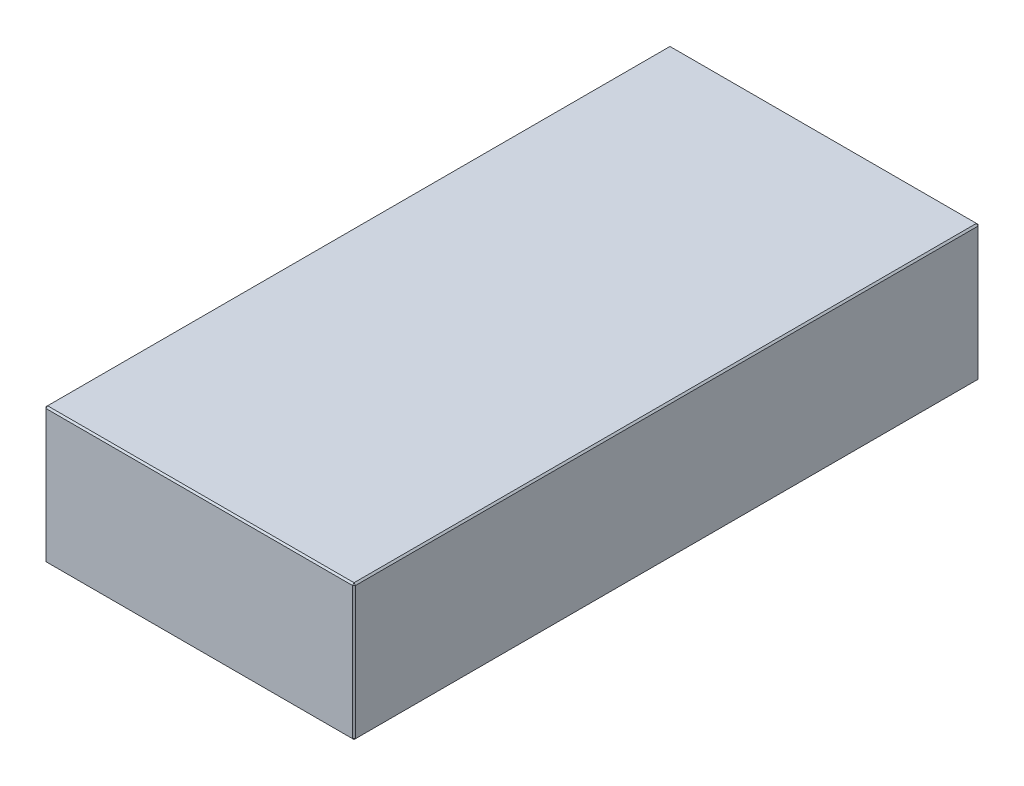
ISO-10303-21;
HEADER;
FILE_DESCRIPTION(('STEP AP214'),'2;1');
FILE_NAME('part.step','',(''),(''),'','','');
FILE_SCHEMA(('AUTOMOTIVE_DESIGN { 1 0 10303 214 1 1 1 1 }'));
ENDSEC;
DATA;
#1=APPLICATION_CONTEXT('core data for automotive mechanical design processes');
#2=APPLICATION_PROTOCOL_DEFINITION('international standard','automotive_design',2000,#1);
#3=PRODUCT_CONTEXT('',#1,'mechanical');
#4=PRODUCT('Part','Part','',(#3));
#5=PRODUCT_RELATED_PRODUCT_CATEGORY('part','',(#4));
#6=PRODUCT_DEFINITION_FORMATION('','',#4);
#7=PRODUCT_DEFINITION_CONTEXT('part definition',#1,'design');
#8=PRODUCT_DEFINITION('design','',#6,#7);
#9=PRODUCT_DEFINITION_SHAPE('','',#8);
#10=(LENGTH_UNIT() NAMED_UNIT(*) SI_UNIT(.MILLI.,.METRE.));
#11=(NAMED_UNIT(*) PLANE_ANGLE_UNIT() SI_UNIT($,.RADIAN.));
#12=(NAMED_UNIT(*) SI_UNIT($,.STERADIAN.) SOLID_ANGLE_UNIT());
#13=UNCERTAINTY_MEASURE_WITH_UNIT(LENGTH_MEASURE(1.E-05),#10,'distance_accuracy_value','');
#14=(GEOMETRIC_REPRESENTATION_CONTEXT(3) GLOBAL_UNCERTAINTY_ASSIGNED_CONTEXT((#13)) GLOBAL_UNIT_ASSIGNED_CONTEXT((#10,
#11,#12)) REPRESENTATION_CONTEXT('',''));
#15=CARTESIAN_POINT('',(0.,0.,0.));
#16=DIRECTION('',(0.,0.,1.));
#17=DIRECTION('',(1.,0.,0.));
#18=AXIS2_PLACEMENT_3D('',#15,#16,#17);
#19=CARTESIAN_POINT('',(-98.,86.,198.));
#20=DIRECTION('',(1.,0.,0.));
#21=DIRECTION('',(0.,0.,-1.));
#22=AXIS2_PLACEMENT_3D('',#19,#20,#21);
#23=PLANE('',#22);
#24=DIRECTION('',(0.,-1.,0.));
#25=VECTOR('',#24,1.);
#26=CARTESIAN_POINT('',(-98.,86.,-197.));
#27=LINE('',#26,#25);
#28=CARTESIAN_POINT('',(-98.,85.,-197.));
#29=VERTEX_POINT('',#28);
#30=CARTESIAN_POINT('',(-98.,1.,-197.));
#31=VERTEX_POINT('',#30);
#32=EDGE_CURVE('E115',#29,#31,#27,.T.);
#33=ORIENTED_EDGE('',*,*,#32,.T.);
#34=DIRECTION('',(0.,0.,1.));
#35=VECTOR('',#34,1.);
#36=CARTESIAN_POINT('',(-98.,1.,198.));
#37=LINE('',#36,#35);
#38=CARTESIAN_POINT('',(-98.,1.,197.));
#39=VERTEX_POINT('',#38);
#40=EDGE_CURVE('E111',#31,#39,#37,.T.);
#41=ORIENTED_EDGE('',*,*,#40,.T.);
#42=DIRECTION('',(0.,1.,0.));
#43=VECTOR('',#42,1.);
#44=CARTESIAN_POINT('',(-98.,86.,197.));
#45=LINE('',#44,#43);
#46=CARTESIAN_POINT('',(-98.,85.,197.));
#47=VERTEX_POINT('',#46);
#48=EDGE_CURVE('E104',#39,#47,#45,.T.);
#49=ORIENTED_EDGE('',*,*,#48,.T.);
#50=DIRECTION('',(0.,0.,-1.));
#51=VECTOR('',#50,1.);
#52=CARTESIAN_POINT('',(-98.,85.,-198.));
#53=LINE('',#52,#51);
#54=EDGE_CURVE('E108',#47,#29,#53,.T.);
#55=ORIENTED_EDGE('',*,*,#54,.T.);
#56=EDGE_LOOP('',(#33,#41,#49,#55));
#57=FACE_BOUND('',#56,.T.);
#58=ADVANCED_FACE('F16',(#57),#23,.F.);
#59=CARTESIAN_POINT('',(98.,86.,198.));
#60=DIRECTION('',(0.,0.,-1.));
#61=DIRECTION('',(-1.,0.,0.));
#62=AXIS2_PLACEMENT_3D('',#59,#60,#61);
#63=PLANE('',#62);
#64=DIRECTION('',(-1.,0.,0.));
#65=VECTOR('',#64,1.);
#66=CARTESIAN_POINT('',(-98.,85.,198.));
#67=LINE('',#66,#65);
#68=CARTESIAN_POINT('',(97.,85.,198.));
#69=VERTEX_POINT('',#68);
#70=CARTESIAN_POINT('',(-97.,85.,198.));
#71=VERTEX_POINT('',#70);
#72=EDGE_CURVE('E165',#69,#71,#67,.T.);
#73=ORIENTED_EDGE('',*,*,#72,.T.);
#74=DIRECTION('',(0.,-1.,0.));
#75=VECTOR('',#74,1.);
#76=CARTESIAN_POINT('',(-97.,86.,198.));
#77=LINE('',#76,#75);
#78=CARTESIAN_POINT('',(-97.,1.,198.));
#79=VERTEX_POINT('',#78);
#80=EDGE_CURVE('E123',#71,#79,#77,.T.);
#81=ORIENTED_EDGE('',*,*,#80,.T.);
#82=DIRECTION('',(1.,0.,0.));
#83=VECTOR('',#82,1.);
#84=CARTESIAN_POINT('',(98.,1.,198.));
#85=LINE('',#84,#83);
#86=CARTESIAN_POINT('',(97.,1.,198.));
#87=VERTEX_POINT('',#86);
#88=EDGE_CURVE('E169',#79,#87,#85,.T.);
#89=ORIENTED_EDGE('',*,*,#88,.T.);
#90=DIRECTION('',(0.,1.,0.));
#91=VECTOR('',#90,1.);
#92=CARTESIAN_POINT('',(97.,86.,198.));
#93=LINE('',#92,#91);
#94=EDGE_CURVE('E167',#87,#69,#93,.T.);
#95=ORIENTED_EDGE('',*,*,#94,.T.);
#96=EDGE_LOOP('',(#73,#81,#89,#95));
#97=FACE_BOUND('',#96,.T.);
#98=ADVANCED_FACE('F276',(#97),#63,.F.);
#99=CARTESIAN_POINT('',(98.,86.,198.));
#100=DIRECTION('',(-1.,0.,0.));
#101=DIRECTION('',(0.,0.,1.));
#102=AXIS2_PLACEMENT_3D('',#99,#100,#101);
#103=PLANE('',#102);
#104=DIRECTION('',(0.,0.,-1.));
#105=VECTOR('',#104,1.);
#106=CARTESIAN_POINT('',(98.,1.,198.));
#107=LINE('',#106,#105);
#108=CARTESIAN_POINT('',(98.,1.,197.));
#109=VERTEX_POINT('',#108);
#110=CARTESIAN_POINT('',(98.,1.,-197.));
#111=VERTEX_POINT('',#110);
#112=EDGE_CURVE('E160',#109,#111,#107,.T.);
#113=ORIENTED_EDGE('',*,*,#112,.T.);
#114=DIRECTION('',(0.,1.,0.));
#115=VECTOR('',#114,1.);
#116=CARTESIAN_POINT('',(98.,86.,-197.));
#117=LINE('',#116,#115);
#118=CARTESIAN_POINT('',(98.,85.,-197.));
#119=VERTEX_POINT('',#118);
#120=EDGE_CURVE('E162',#111,#119,#117,.T.);
#121=ORIENTED_EDGE('',*,*,#120,.T.);
#122=DIRECTION('',(0.,0.,1.));
#123=VECTOR('',#122,1.);
#124=CARTESIAN_POINT('',(98.,85.,198.));
#125=LINE('',#124,#123);
#126=CARTESIAN_POINT('',(98.,85.,197.));
#127=VERTEX_POINT('',#126);
#128=EDGE_CURVE('E156',#119,#127,#125,.T.);
#129=ORIENTED_EDGE('',*,*,#128,.T.);
#130=DIRECTION('',(0.,-1.,0.));
#131=VECTOR('',#130,1.);
#132=CARTESIAN_POINT('',(98.,86.,197.));
#133=LINE('',#132,#131);
#134=EDGE_CURVE('E158',#127,#109,#133,.T.);
#135=ORIENTED_EDGE('',*,*,#134,.T.);
#136=EDGE_LOOP('',(#113,#121,#129,#135));
#137=FACE_BOUND('',#136,.T.);
#138=ADVANCED_FACE('F255',(#137),#103,.F.);
#139=CARTESIAN_POINT('',(98.,86.,-198.));
#140=DIRECTION('',(0.,0.,1.));
#141=DIRECTION('',(1.,0.,0.));
#142=AXIS2_PLACEMENT_3D('',#139,#140,#141);
#143=PLANE('',#142);
#144=DIRECTION('',(0.,-1.,0.));
#145=VECTOR('',#144,1.);
#146=CARTESIAN_POINT('',(97.,86.,-198.));
#147=LINE('',#146,#145);
#148=CARTESIAN_POINT('',(97.,85.,-198.));
#149=VERTEX_POINT('',#148);
#150=CARTESIAN_POINT('',(97.,1.,-198.));
#151=VERTEX_POINT('',#150);
#152=EDGE_CURVE('E149',#149,#151,#147,.T.);
#153=ORIENTED_EDGE('',*,*,#152,.T.);
#154=DIRECTION('',(-1.,0.,0.));
#155=VECTOR('',#154,1.);
#156=CARTESIAN_POINT('',(98.,1.,-198.));
#157=LINE('',#156,#155);
#158=CARTESIAN_POINT('',(-97.,1.,-198.));
#159=VERTEX_POINT('',#158);
#160=EDGE_CURVE('E154',#151,#159,#157,.T.);
#161=ORIENTED_EDGE('',*,*,#160,.T.);
#162=DIRECTION('',(0.,1.,0.));
#163=VECTOR('',#162,1.);
#164=CARTESIAN_POINT('',(-97.,86.,-198.));
#165=LINE('',#164,#163);
#166=CARTESIAN_POINT('',(-97.,85.,-198.));
#167=VERTEX_POINT('',#166);
#168=EDGE_CURVE('E151',#159,#167,#165,.T.);
#169=ORIENTED_EDGE('',*,*,#168,.T.);
#170=DIRECTION('',(1.,0.,0.));
#171=VECTOR('',#170,1.);
#172=CARTESIAN_POINT('',(98.,85.,-198.));
#173=LINE('',#172,#171);
#174=EDGE_CURVE('E147',#167,#149,#173,.T.);
#175=ORIENTED_EDGE('',*,*,#174,.T.);
#176=EDGE_LOOP('',(#153,#161,#169,#175));
#177=FACE_BOUND('',#176,.T.);
#178=ADVANCED_FACE('F285',(#177),#143,.F.);
#179=CARTESIAN_POINT('',(0.,86.,0.));
#180=DIRECTION('',(0.,1.,0.));
#181=DIRECTION('',(0.,0.,1.));
#182=AXIS2_PLACEMENT_3D('',#179,#180,#181);
#183=PLANE('',#182);
#184=DIRECTION('',(0.,0.,-1.));
#185=VECTOR('',#184,1.);
#186=CARTESIAN_POINT('',(97.,86.,-198.));
#187=LINE('',#186,#185);
#188=CARTESIAN_POINT('',(97.,86.,197.));
#189=VERTEX_POINT('',#188);
#190=CARTESIAN_POINT('',(97.,86.,-197.));
#191=VERTEX_POINT('',#190);
#192=EDGE_CURVE('E25',#189,#191,#187,.T.);
#193=ORIENTED_EDGE('',*,*,#192,.T.);
#194=DIRECTION('',(-1.,0.,0.));
#195=VECTOR('',#194,1.);
#196=CARTESIAN_POINT('',(-98.,86.,-197.));
#197=LINE('',#196,#195);
#198=CARTESIAN_POINT('',(-97.,86.,-197.));
#199=VERTEX_POINT('',#198);
#200=EDGE_CURVE('E10',#191,#199,#197,.T.);
#201=ORIENTED_EDGE('',*,*,#200,.T.);
#202=DIRECTION('',(0.,0.,1.));
#203=VECTOR('',#202,1.);
#204=CARTESIAN_POINT('',(-97.,86.,198.));
#205=LINE('',#204,#203);
#206=CARTESIAN_POINT('',(-97.,86.,197.));
#207=VERTEX_POINT('',#206);
#208=EDGE_CURVE('E181',#199,#207,#205,.T.);
#209=ORIENTED_EDGE('',*,*,#208,.T.);
#210=DIRECTION('',(1.,0.,0.));
#211=VECTOR('',#210,1.);
#212=CARTESIAN_POINT('',(98.,86.,197.));
#213=LINE('',#212,#211);
#214=EDGE_CURVE('E36',#207,#189,#213,.T.);
#215=ORIENTED_EDGE('',*,*,#214,.T.);
#216=EDGE_LOOP('',(#193,#201,#209,#215));
#217=FACE_BOUND('',#216,.T.);
#218=ADVANCED_FACE('F351',(#217),#183,.T.);
#219=CARTESIAN_POINT('',(0.,0.,0.));
#220=DIRECTION('',(0.,1.,0.));
#221=DIRECTION('',(0.,0.,1.));
#222=AXIS2_PLACEMENT_3D('',#219,#220,#221);
#223=PLANE('',#222);
#224=DIRECTION('',(0.,0.,1.));
#225=VECTOR('',#224,1.);
#226=CARTESIAN_POINT('',(97.,0.,0.));
#227=LINE('',#226,#225);
#228=CARTESIAN_POINT('',(97.,0.,-197.));
#229=VERTEX_POINT('',#228);
#230=CARTESIAN_POINT('',(97.,0.,197.));
#231=VERTEX_POINT('',#230);
#232=EDGE_CURVE('E172',#229,#231,#227,.T.);
#233=ORIENTED_EDGE('',*,*,#232,.T.);
#234=DIRECTION('',(-1.,0.,0.));
#235=VECTOR('',#234,1.);
#236=CARTESIAN_POINT('',(0.,0.,197.));
#237=LINE('',#236,#235);
#238=CARTESIAN_POINT('',(-97.,0.,197.));
#239=VERTEX_POINT('',#238);
#240=EDGE_CURVE('E178',#231,#239,#237,.T.);
#241=ORIENTED_EDGE('',*,*,#240,.T.);
#242=DIRECTION('',(0.,0.,-1.));
#243=VECTOR('',#242,1.);
#244=CARTESIAN_POINT('',(-97.,0.,0.));
#245=LINE('',#244,#243);
#246=CARTESIAN_POINT('',(-97.,0.,-197.));
#247=VERTEX_POINT('',#246);
#248=EDGE_CURVE('E176',#239,#247,#245,.T.);
#249=ORIENTED_EDGE('',*,*,#248,.T.);
#250=DIRECTION('',(1.,0.,0.));
#251=VECTOR('',#250,1.);
#252=CARTESIAN_POINT('',(0.,0.,-197.));
#253=LINE('',#252,#251);
#254=EDGE_CURVE('E174',#247,#229,#253,.T.);
#255=ORIENTED_EDGE('',*,*,#254,.T.);
#256=EDGE_LOOP('',(#233,#241,#249,#255));
#257=FACE_BOUND('',#256,.T.);
#258=ADVANCED_FACE('F247',(#257),#223,.F.);
#259=CARTESIAN_POINT('',(98.,86.,197.));
#260=DIRECTION('',(-0.707106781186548,0.,-0.707106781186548));
#261=DIRECTION('',(0.,-1.,0.));
#262=AXIS2_PLACEMENT_3D('',#259,#260,#261);
#263=PLANE('',#262);
#264=DIRECTION('',(-0.707106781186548,0.,0.707106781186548));
#265=VECTOR('',#264,1.);
#266=CARTESIAN_POINT('',(97.,85.,198.));
#267=LINE('',#266,#265);
#268=EDGE_CURVE('E20',#69,#127,#267,.F.);
#269=ORIENTED_EDGE('',*,*,#268,.F.);
#270=ORIENTED_EDGE('',*,*,#94,.F.);
#271=DIRECTION('',(0.707106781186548,0.,-0.707106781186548));
#272=VECTOR('',#271,1.);
#273=CARTESIAN_POINT('',(97.,1.,198.));
#274=LINE('',#273,#272);
#275=EDGE_CURVE('E143',#109,#87,#274,.F.);
#276=ORIENTED_EDGE('',*,*,#275,.F.);
#277=ORIENTED_EDGE('',*,*,#134,.F.);
#278=EDGE_LOOP('',(#269,#270,#276,#277));
#279=FACE_BOUND('',#278,.T.);
#280=ADVANCED_FACE('F18',(#279),#263,.F.);
#281=CARTESIAN_POINT('',(97.,85.,198.));
#282=DIRECTION('',(0.577350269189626,0.577350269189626,0.577350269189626));
#283=DIRECTION('',(0.707106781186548,0.,-0.707106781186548));
#284=AXIS2_PLACEMENT_3D('',#281,#282,#283);
#285=PLANE('',#284);
#286=DIRECTION('',(0.,-0.707106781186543,0.707106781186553));
#287=VECTOR('',#286,1.);
#288=CARTESIAN_POINT('',(97.,85.,198.));
#289=LINE('',#288,#287);
#290=EDGE_CURVE('E227',#69,#189,#289,.F.);
#291=ORIENTED_EDGE('',*,*,#290,.F.);
#292=ORIENTED_EDGE('',*,*,#268,.T.);
#293=DIRECTION('',(-0.707106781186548,0.707106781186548,0.));
#294=VECTOR('',#293,1.);
#295=CARTESIAN_POINT('',(97.5,85.5,197.));
#296=LINE('',#295,#294);
#297=EDGE_CURVE('E229',#189,#127,#296,.F.);
#298=ORIENTED_EDGE('',*,*,#297,.F.);
#299=EDGE_LOOP('',(#291,#292,#298));
#300=FACE_BOUND('',#299,.T.);
#301=ADVANCED_FACE('F271',(#300),#285,.T.);
#302=CARTESIAN_POINT('',(97.,1.,198.));
#303=DIRECTION('',(0.57735026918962,-0.577350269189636,0.57735026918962));
#304=DIRECTION('',(0.,-0.707106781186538,-0.707106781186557));
#305=AXIS2_PLACEMENT_3D('',#302,#303,#304);
#306=PLANE('',#305);
#307=DIRECTION('',(-0.707106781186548,-0.707106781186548,0.));
#308=VECTOR('',#307,1.);
#309=CARTESIAN_POINT('',(97.5,0.500000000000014,197.));
#310=LINE('',#309,#308);
#311=EDGE_CURVE('E221',#109,#231,#310,.T.);
#312=ORIENTED_EDGE('',*,*,#311,.F.);
#313=ORIENTED_EDGE('',*,*,#275,.T.);
#314=DIRECTION('',(0.,0.707106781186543,0.707106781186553));
#315=VECTOR('',#314,1.);
#316=CARTESIAN_POINT('',(97.,1.,198.));
#317=LINE('',#316,#315);
#318=EDGE_CURVE('E224',#231,#87,#317,.T.);
#319=ORIENTED_EDGE('',*,*,#318,.F.);
#320=EDGE_LOOP('',(#312,#313,#319));
#321=FACE_BOUND('',#320,.T.);
#322=ADVANCED_FACE('F236',(#321),#306,.T.);
#323=CARTESIAN_POINT('',(97.,86.,0.));
#324=DIRECTION('',(0.707106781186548,0.707106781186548,0.));
#325=DIRECTION('',(0.,0.,1.));
#326=AXIS2_PLACEMENT_3D('',#323,#324,#325);
#327=PLANE('',#326);
#328=ORIENTED_EDGE('',*,*,#297,.T.);
#329=ORIENTED_EDGE('',*,*,#128,.F.);
#330=DIRECTION('',(0.707106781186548,-0.707106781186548,0.));
#331=VECTOR('',#330,1.);
#332=CARTESIAN_POINT('',(98.,85.,-197.));
#333=LINE('',#332,#331);
#334=EDGE_CURVE('E216',#191,#119,#333,.T.);
#335=ORIENTED_EDGE('',*,*,#334,.F.);
#336=ORIENTED_EDGE('',*,*,#192,.F.);
#337=EDGE_LOOP('',(#328,#329,#335,#336));
#338=FACE_BOUND('',#337,.T.);
#339=ADVANCED_FACE('F266',(#338),#327,.T.);
#340=CARTESIAN_POINT('',(0.,86.,197.));
#341=DIRECTION('',(0.,0.707106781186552,0.707106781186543));
#342=DIRECTION('',(-1.,0.,0.));
#343=AXIS2_PLACEMENT_3D('',#340,#341,#342);
#344=PLANE('',#343);
#345=ORIENTED_EDGE('',*,*,#290,.T.);
#346=ORIENTED_EDGE('',*,*,#214,.F.);
#347=DIRECTION('',(0.,0.707106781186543,-0.707106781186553));
#348=VECTOR('',#347,1.);
#349=CARTESIAN_POINT('',(-97.,85.5,197.5));
#350=LINE('',#349,#348);
#351=EDGE_CURVE('E127',#71,#207,#350,.T.);
#352=ORIENTED_EDGE('',*,*,#351,.F.);
#353=ORIENTED_EDGE('',*,*,#72,.F.);
#354=EDGE_LOOP('',(#345,#346,#352,#353));
#355=FACE_BOUND('',#354,.T.);
#356=ADVANCED_FACE('F274',(#355),#344,.T.);
#357=CARTESIAN_POINT('',(-97.,86.,198.));
#358=DIRECTION('',(0.707106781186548,0.,-0.707106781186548));
#359=DIRECTION('',(0.,-1.,0.));
#360=AXIS2_PLACEMENT_3D('',#357,#358,#359);
#361=PLANE('',#360);
#362=DIRECTION('',(0.707106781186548,0.,0.707106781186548));
#363=VECTOR('',#362,1.);
#364=CARTESIAN_POINT('',(-97.,1.,198.));
#365=LINE('',#364,#363);
#366=EDGE_CURVE('E128',#79,#39,#365,.F.);
#367=ORIENTED_EDGE('',*,*,#366,.F.);
#368=ORIENTED_EDGE('',*,*,#80,.F.);
#369=DIRECTION('',(-0.707106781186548,0.,-0.707106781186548));
#370=VECTOR('',#369,1.);
#371=CARTESIAN_POINT('',(-98.,85.,197.));
#372=LINE('',#371,#370);
#373=EDGE_CURVE('E119',#47,#71,#372,.F.);
#374=ORIENTED_EDGE('',*,*,#373,.F.);
#375=ORIENTED_EDGE('',*,*,#48,.F.);
#376=EDGE_LOOP('',(#367,#368,#374,#375));
#377=FACE_BOUND('',#376,.T.);
#378=ADVANCED_FACE('F121',(#377),#361,.F.);
#379=CARTESIAN_POINT('',(98.,1.,198.));
#380=DIRECTION('',(0.,0.707106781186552,-0.707106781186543));
#381=DIRECTION('',(1.,0.,0.));
#382=AXIS2_PLACEMENT_3D('',#379,#380,#381);
#383=PLANE('',#382);
#384=ORIENTED_EDGE('',*,*,#318,.T.);
#385=ORIENTED_EDGE('',*,*,#88,.F.);
#386=DIRECTION('',(0.,-0.707106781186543,-0.707106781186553));
#387=VECTOR('',#386,1.);
#388=CARTESIAN_POINT('',(-97.,1.,198.));
#389=LINE('',#388,#387);
#390=EDGE_CURVE('E212',#239,#79,#389,.F.);
#391=ORIENTED_EDGE('',*,*,#390,.F.);
#392=ORIENTED_EDGE('',*,*,#240,.F.);
#393=EDGE_LOOP('',(#384,#385,#391,#392));
#394=FACE_BOUND('',#393,.T.);
#395=ADVANCED_FACE('F244',(#394),#383,.F.);
#396=CARTESIAN_POINT('',(98.,1.,198.));
#397=DIRECTION('',(-0.707106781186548,0.707106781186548,0.));
#398=DIRECTION('',(0.,0.,-1.));
#399=AXIS2_PLACEMENT_3D('',#396,#397,#398);
#400=PLANE('',#399);
#401=ORIENTED_EDGE('',*,*,#311,.T.);
#402=ORIENTED_EDGE('',*,*,#232,.F.);
#403=DIRECTION('',(0.707106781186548,0.707106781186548,0.));
#404=VECTOR('',#403,1.);
#405=CARTESIAN_POINT('',(97.5,0.500000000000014,-197.));
#406=LINE('',#405,#404);
#407=EDGE_CURVE('E209',#111,#229,#406,.F.);
#408=ORIENTED_EDGE('',*,*,#407,.F.);
#409=ORIENTED_EDGE('',*,*,#112,.F.);
#410=EDGE_LOOP('',(#401,#402,#408,#409));
#411=FACE_BOUND('',#410,.T.);
#412=ADVANCED_FACE('F252',(#411),#400,.F.);
#413=CARTESIAN_POINT('',(97.,86.,-198.));
#414=DIRECTION('',(-0.707106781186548,0.,0.707106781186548));
#415=DIRECTION('',(0.,-1.,0.));
#416=AXIS2_PLACEMENT_3D('',#413,#414,#415);
#417=PLANE('',#416);
#418=DIRECTION('',(0.707106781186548,0.,0.707106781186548));
#419=VECTOR('',#418,1.);
#420=CARTESIAN_POINT('',(98.,85.,-197.));
#421=LINE('',#420,#419);
#422=EDGE_CURVE('E218',#119,#149,#421,.F.);
#423=ORIENTED_EDGE('',*,*,#422,.F.);
#424=ORIENTED_EDGE('',*,*,#120,.F.);
#425=DIRECTION('',(-0.707106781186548,0.,-0.707106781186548));
#426=VECTOR('',#425,1.);
#427=CARTESIAN_POINT('',(97.,1.,-198.));
#428=LINE('',#427,#426);
#429=EDGE_CURVE('E206',#151,#111,#428,.F.);
#430=ORIENTED_EDGE('',*,*,#429,.F.);
#431=ORIENTED_EDGE('',*,*,#152,.F.);
#432=EDGE_LOOP('',(#423,#424,#430,#431));
#433=FACE_BOUND('',#432,.T.);
#434=ADVANCED_FACE('F259',(#433),#417,.F.);
#435=CARTESIAN_POINT('',(98.,85.,-197.));
#436=DIRECTION('',(0.577350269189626,0.577350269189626,-0.577350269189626));
#437=DIRECTION('',(-0.707106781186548,0.,-0.707106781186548));
#438=AXIS2_PLACEMENT_3D('',#435,#436,#437);
#439=PLANE('',#438);
#440=ORIENTED_EDGE('',*,*,#334,.T.);
#441=ORIENTED_EDGE('',*,*,#422,.T.);
#442=DIRECTION('',(0.,0.707106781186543,0.707106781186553));
#443=VECTOR('',#442,1.);
#444=CARTESIAN_POINT('',(97.,85.5,-197.5));
#445=LINE('',#444,#443);
#446=EDGE_CURVE('E135',#191,#149,#445,.F.);
#447=ORIENTED_EDGE('',*,*,#446,.F.);
#448=EDGE_LOOP('',(#440,#441,#447));
#449=FACE_BOUND('',#448,.T.);
#450=ADVANCED_FACE('F326',(#449),#439,.T.);
#451=CARTESIAN_POINT('',(-98.,85.,197.));
#452=DIRECTION('',(-0.577350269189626,0.577350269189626,0.577350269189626));
#453=DIRECTION('',(0.707106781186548,0.,0.707106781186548));
#454=AXIS2_PLACEMENT_3D('',#451,#452,#453);
#455=PLANE('',#454);
#456=ORIENTED_EDGE('',*,*,#373,.T.);
#457=ORIENTED_EDGE('',*,*,#351,.T.);
#458=DIRECTION('',(-0.707106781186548,-0.707106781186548,0.));
#459=VECTOR('',#458,1.);
#460=CARTESIAN_POINT('',(-98.,85.,197.));
#461=LINE('',#460,#459);
#462=EDGE_CURVE('E131',#47,#207,#461,.F.);
#463=ORIENTED_EDGE('',*,*,#462,.F.);
#464=EDGE_LOOP('',(#456,#457,#463));
#465=FACE_BOUND('',#464,.T.);
#466=ADVANCED_FACE('F132',(#465),#455,.T.);
#467=CARTESIAN_POINT('',(-97.,1.,198.));
#468=DIRECTION('',(-0.57735026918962,-0.577350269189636,0.57735026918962));
#469=DIRECTION('',(0.,-0.707106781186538,-0.707106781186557));
#470=AXIS2_PLACEMENT_3D('',#467,#468,#469);
#471=PLANE('',#470);
#472=ORIENTED_EDGE('',*,*,#390,.T.);
#473=ORIENTED_EDGE('',*,*,#366,.T.);
#474=DIRECTION('',(-0.707106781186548,0.707106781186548,0.));
#475=VECTOR('',#474,1.);
#476=CARTESIAN_POINT('',(-97.5,0.500000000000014,197.));
#477=LINE('',#476,#475);
#478=EDGE_CURVE('E136',#239,#39,#477,.T.);
#479=ORIENTED_EDGE('',*,*,#478,.F.);
#480=EDGE_LOOP('',(#472,#473,#479));
#481=FACE_BOUND('',#480,.T.);
#482=ADVANCED_FACE('F319',(#481),#471,.T.);
#483=CARTESIAN_POINT('',(97.,1.,-198.));
#484=DIRECTION('',(0.57735026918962,-0.577350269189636,-0.57735026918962));
#485=DIRECTION('',(0.,0.707106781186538,-0.707106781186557));
#486=AXIS2_PLACEMENT_3D('',#483,#484,#485);
#487=PLANE('',#486);
#488=ORIENTED_EDGE('',*,*,#429,.T.);
#489=ORIENTED_EDGE('',*,*,#407,.T.);
#490=DIRECTION('',(0.,-0.707106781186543,0.707106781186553));
#491=VECTOR('',#490,1.);
#492=CARTESIAN_POINT('',(97.,1.,-198.));
#493=LINE('',#492,#491);
#494=EDGE_CURVE('E199',#151,#229,#493,.T.);
#495=ORIENTED_EDGE('',*,*,#494,.F.);
#496=EDGE_LOOP('',(#488,#489,#495));
#497=FACE_BOUND('',#496,.T.);
#498=ADVANCED_FACE('F315',(#497),#487,.T.);
#499=CARTESIAN_POINT('',(0.,86.,-197.));
#500=DIRECTION('',(0.,0.707106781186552,-0.707106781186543));
#501=DIRECTION('',(1.,0.,0.));
#502=AXIS2_PLACEMENT_3D('',#499,#500,#501);
#503=PLANE('',#502);
#504=ORIENTED_EDGE('',*,*,#446,.T.);
#505=ORIENTED_EDGE('',*,*,#174,.F.);
#506=DIRECTION('',(0.,-0.707106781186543,-0.707106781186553));
#507=VECTOR('',#506,1.);
#508=CARTESIAN_POINT('',(-97.,85.,-198.));
#509=LINE('',#508,#507);
#510=EDGE_CURVE('E196',#199,#167,#509,.T.);
#511=ORIENTED_EDGE('',*,*,#510,.F.);
#512=ORIENTED_EDGE('',*,*,#200,.F.);
#513=EDGE_LOOP('',(#504,#505,#511,#512));
#514=FACE_BOUND('',#513,.T.);
#515=ADVANCED_FACE('F312',(#514),#503,.T.);
#516=CARTESIAN_POINT('',(-97.,86.,0.));
#517=DIRECTION('',(-0.707106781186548,0.707106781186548,0.));
#518=DIRECTION('',(0.,0.,-1.));
#519=AXIS2_PLACEMENT_3D('',#516,#517,#518);
#520=PLANE('',#519);
#521=ORIENTED_EDGE('',*,*,#462,.T.);
#522=ORIENTED_EDGE('',*,*,#208,.F.);
#523=DIRECTION('',(0.707106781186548,0.707106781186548,0.));
#524=VECTOR('',#523,1.);
#525=CARTESIAN_POINT('',(-97.5,85.5,-197.));
#526=LINE('',#525,#524);
#527=EDGE_CURVE('E139',#29,#199,#526,.T.);
#528=ORIENTED_EDGE('',*,*,#527,.F.);
#529=ORIENTED_EDGE('',*,*,#54,.F.);
#530=EDGE_LOOP('',(#521,#522,#528,#529));
#531=FACE_BOUND('',#530,.T.);
#532=ADVANCED_FACE('F138',(#531),#520,.T.);
#533=CARTESIAN_POINT('',(-98.,1.,198.));
#534=DIRECTION('',(0.707106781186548,0.707106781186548,0.));
#535=DIRECTION('',(0.,0.,1.));
#536=AXIS2_PLACEMENT_3D('',#533,#534,#535);
#537=PLANE('',#536);
#538=ORIENTED_EDGE('',*,*,#478,.T.);
#539=ORIENTED_EDGE('',*,*,#40,.F.);
#540=DIRECTION('',(0.707106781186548,-0.707106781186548,0.));
#541=VECTOR('',#540,1.);
#542=CARTESIAN_POINT('',(-98.,1.,-197.));
#543=LINE('',#542,#541);
#544=EDGE_CURVE('E192',#247,#31,#543,.F.);
#545=ORIENTED_EDGE('',*,*,#544,.F.);
#546=ORIENTED_EDGE('',*,*,#248,.F.);
#547=EDGE_LOOP('',(#538,#539,#545,#546));
#548=FACE_BOUND('',#547,.T.);
#549=ADVANCED_FACE('F305',(#548),#537,.F.);
#550=CARTESIAN_POINT('',(98.,1.,-198.));
#551=DIRECTION('',(0.,0.707106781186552,0.707106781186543));
#552=DIRECTION('',(-1.,0.,0.));
#553=AXIS2_PLACEMENT_3D('',#550,#551,#552);
#554=PLANE('',#553);
#555=ORIENTED_EDGE('',*,*,#494,.T.);
#556=ORIENTED_EDGE('',*,*,#254,.F.);
#557=DIRECTION('',(0.,0.707106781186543,-0.707106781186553));
#558=VECTOR('',#557,1.);
#559=CARTESIAN_POINT('',(-97.,0.500000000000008,-197.5));
#560=LINE('',#559,#558);
#561=EDGE_CURVE('E189',#159,#247,#560,.F.);
#562=ORIENTED_EDGE('',*,*,#561,.F.);
#563=ORIENTED_EDGE('',*,*,#160,.F.);
#564=EDGE_LOOP('',(#555,#556,#562,#563));
#565=FACE_BOUND('',#564,.T.);
#566=ADVANCED_FACE('F301',(#565),#554,.F.);
#567=CARTESIAN_POINT('',(-97.,85.,-198.));
#568=DIRECTION('',(-0.577350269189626,0.577350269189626,-0.577350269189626));
#569=DIRECTION('',(-0.707106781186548,0.,0.707106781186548));
#570=AXIS2_PLACEMENT_3D('',#567,#568,#569);
#571=PLANE('',#570);
#572=ORIENTED_EDGE('',*,*,#527,.T.);
#573=ORIENTED_EDGE('',*,*,#510,.T.);
#574=DIRECTION('',(0.707106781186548,0.,-0.707106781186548));
#575=VECTOR('',#574,1.);
#576=CARTESIAN_POINT('',(-97.,85.,-198.));
#577=LINE('',#576,#575);
#578=EDGE_CURVE('E187',#29,#167,#577,.T.);
#579=ORIENTED_EDGE('',*,*,#578,.F.);
#580=EDGE_LOOP('',(#572,#573,#579));
#581=FACE_BOUND('',#580,.T.);
#582=ADVANCED_FACE('F297',(#581),#571,.T.);
#583=CARTESIAN_POINT('',(-98.,1.,-197.));
#584=DIRECTION('',(-0.57735026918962,-0.577350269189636,-0.57735026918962));
#585=DIRECTION('',(0.,0.707106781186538,-0.707106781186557));
#586=AXIS2_PLACEMENT_3D('',#583,#584,#585);
#587=PLANE('',#586);
#588=ORIENTED_EDGE('',*,*,#561,.T.);
#589=ORIENTED_EDGE('',*,*,#544,.T.);
#590=DIRECTION('',(-0.707106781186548,0.,0.707106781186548));
#591=VECTOR('',#590,1.);
#592=CARTESIAN_POINT('',(-98.,1.,-197.));
#593=LINE('',#592,#591);
#594=EDGE_CURVE('E185',#159,#31,#593,.T.);
#595=ORIENTED_EDGE('',*,*,#594,.F.);
#596=EDGE_LOOP('',(#588,#589,#595));
#597=FACE_BOUND('',#596,.T.);
#598=ADVANCED_FACE('F293',(#597),#587,.T.);
#599=CARTESIAN_POINT('',(-98.,86.,-197.));
#600=DIRECTION('',(0.707106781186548,0.,0.707106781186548));
#601=DIRECTION('',(0.,-1.,0.));
#602=AXIS2_PLACEMENT_3D('',#599,#600,#601);
#603=PLANE('',#602);
#604=ORIENTED_EDGE('',*,*,#578,.T.);
#605=ORIENTED_EDGE('',*,*,#168,.F.);
#606=ORIENTED_EDGE('',*,*,#594,.T.);
#607=ORIENTED_EDGE('',*,*,#32,.F.);
#608=EDGE_LOOP('',(#604,#605,#606,#607));
#609=FACE_BOUND('',#608,.T.);
#610=ADVANCED_FACE('F290',(#609),#603,.F.);
#611=CLOSED_SHELL('',(#58,#98,#138,#178,#218,#258,#280,#301,#322,#339,#356,#378,#395,#412,#434,
#450,#466,#482,#498,#515,#532,#549,#566,#582,#598,#610));
#612=MANIFOLD_SOLID_BREP('B1',#611);
#613=ADVANCED_BREP_SHAPE_REPRESENTATION('',(#18,#612),#14);
#614=SHAPE_DEFINITION_REPRESENTATION(#9,#613);
ENDSEC;
END-ISO-10303-21;
